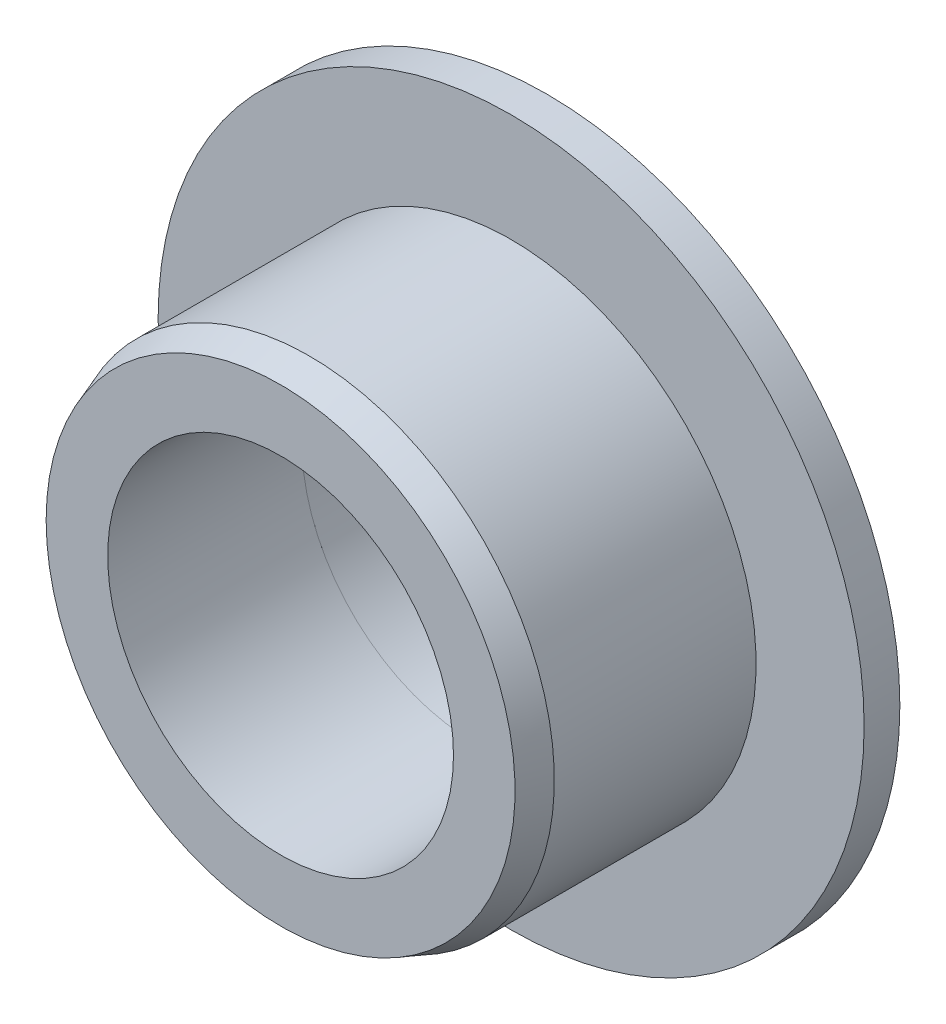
ISO-10303-21;
HEADER;
FILE_DESCRIPTION(('STEP AP214'),'2;1');
FILE_NAME('part.step','',(''),(''),'','','');
FILE_SCHEMA(('AUTOMOTIVE_DESIGN { 1 0 10303 214 1 1 1 1 }'));
ENDSEC;
DATA;
#1=APPLICATION_CONTEXT('core data for automotive mechanical design processes');
#2=APPLICATION_PROTOCOL_DEFINITION('international standard','automotive_design',2000,#1);
#3=PRODUCT_CONTEXT('',#1,'mechanical');
#4=PRODUCT('Part','Part','',(#3));
#5=PRODUCT_RELATED_PRODUCT_CATEGORY('part','',(#4));
#6=PRODUCT_DEFINITION_FORMATION('','',#4);
#7=PRODUCT_DEFINITION_CONTEXT('part definition',#1,'design');
#8=PRODUCT_DEFINITION('design','',#6,#7);
#9=PRODUCT_DEFINITION_SHAPE('','',#8);
#10=(LENGTH_UNIT() NAMED_UNIT(*) SI_UNIT(.MILLI.,.METRE.));
#11=(NAMED_UNIT(*) PLANE_ANGLE_UNIT() SI_UNIT($,.RADIAN.));
#12=(NAMED_UNIT(*) SI_UNIT($,.STERADIAN.) SOLID_ANGLE_UNIT());
#13=UNCERTAINTY_MEASURE_WITH_UNIT(LENGTH_MEASURE(1.E-05),#10,'distance_accuracy_value','');
#14=(GEOMETRIC_REPRESENTATION_CONTEXT(3) GLOBAL_UNCERTAINTY_ASSIGNED_CONTEXT((#13)) GLOBAL_UNIT_ASSIGNED_CONTEXT((#10,
#11,#12)) REPRESENTATION_CONTEXT('',''));
#15=CARTESIAN_POINT('',(0.,0.,0.));
#16=DIRECTION('',(0.,0.,1.));
#17=DIRECTION('',(1.,0.,0.));
#18=AXIS2_PLACEMENT_3D('',#15,#16,#17);
#19=CARTESIAN_POINT('',(-2.22044604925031E-13,6.66133814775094E-13,-2.22044604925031E-13));
#20=DIRECTION('',(0.,0.,1.));
#21=DIRECTION('',(1.,0.,0.));
#22=AXIS2_PLACEMENT_3D('',#19,#20,#21);
#23=CYLINDRICAL_SURFACE('',#22,12.);
#24=CARTESIAN_POINT('',(6.66133814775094E-13,-8.88178419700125E-13,18.4799999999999));
#25=DIRECTION('',(0.,0.,1.));
#26=DIRECTION('',(1.,0.,0.));
#27=AXIS2_PLACEMENT_3D('',#24,#25,#26);
#28=CIRCLE('',#27,12.);
#29=CARTESIAN_POINT('',(11.9999999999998,6.9150019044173E-13,18.4799999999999));
#30=VERTEX_POINT('',#29);
#31=EDGE_CURVE('E56',#30,#30,#28,.T.);
#32=CARTESIAN_POINT('',(2.22044604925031E-13,4.44089209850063E-13,5.));
#33=DIRECTION('',(0.,0.,-1.));
#34=DIRECTION('',(-1.,0.,0.));
#35=AXIS2_PLACEMENT_3D('',#32,#33,#34);
#36=CIRCLE('',#35,12.);
#37=CARTESIAN_POINT('',(11.9999999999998,6.90003609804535E-13,5.00000000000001));
#38=VERTEX_POINT('',#37);
#39=EDGE_CURVE('E38',#38,#38,#36,.F.);
#40=CARTESIAN_POINT('',(11.9999999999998,6.9150019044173E-13,18.4799999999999));
#41=CARTESIAN_POINT('',(11.9999999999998,6.91484601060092E-13,18.3395833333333));
#42=CARTESIAN_POINT('',(11.9999999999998,6.91469011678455E-13,18.1991666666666));
#43=CARTESIAN_POINT('',(11.9999999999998,6.9143783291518E-13,17.9183333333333));
#44=CARTESIAN_POINT('',(11.9999999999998,6.91422243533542E-13,17.7779166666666));
#45=CARTESIAN_POINT('',(11.9999999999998,6.91391064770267E-13,17.4970833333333));
#46=CARTESIAN_POINT('',(11.9999999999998,6.9137547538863E-13,17.3566666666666));
#47=CARTESIAN_POINT('',(11.9999999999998,6.91344296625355E-13,17.0758333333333));
#48=CARTESIAN_POINT('',(11.9999999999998,6.91328707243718E-13,16.9354166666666));
#49=CARTESIAN_POINT('',(11.9999999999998,6.91297528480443E-13,16.6545833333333));
#50=CARTESIAN_POINT('',(11.9999999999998,6.91281939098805E-13,16.5141666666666));
#51=CARTESIAN_POINT('',(11.9999999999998,6.9125076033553E-13,16.2333333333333));
#52=CARTESIAN_POINT('',(11.9999999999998,6.91235170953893E-13,16.0929166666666));
#53=CARTESIAN_POINT('',(11.9999999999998,6.91203992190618E-13,15.8120833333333));
#54=CARTESIAN_POINT('',(11.9999999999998,6.91188402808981E-13,15.6716666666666));
#55=CARTESIAN_POINT('',(11.9999999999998,6.91157224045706E-13,15.3908333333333));
#56=CARTESIAN_POINT('',(11.9999999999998,6.91141634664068E-13,15.2504166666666));
#57=CARTESIAN_POINT('',(11.9999999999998,6.91110455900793E-13,14.9695833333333));
#58=CARTESIAN_POINT('',(11.9999999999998,6.91094866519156E-13,14.8291666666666));
#59=CARTESIAN_POINT('',(11.9999999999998,6.91063687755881E-13,14.5483333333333));
#60=CARTESIAN_POINT('',(11.9999999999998,6.91048098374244E-13,14.4079166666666));
#61=CARTESIAN_POINT('',(11.9999999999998,6.91016919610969E-13,14.1270833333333));
#62=CARTESIAN_POINT('',(11.9999999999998,6.91001330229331E-13,13.9866666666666));
#63=CARTESIAN_POINT('',(11.9999999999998,6.90970151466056E-13,13.7058333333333));
#64=CARTESIAN_POINT('',(11.9999999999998,6.90954562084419E-13,13.5654166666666));
#65=CARTESIAN_POINT('',(11.9999999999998,6.90923383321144E-13,13.2845833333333));
#66=CARTESIAN_POINT('',(11.9999999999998,6.90907793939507E-13,13.1441666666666));
#67=CARTESIAN_POINT('',(11.9999999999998,6.90876615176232E-13,12.8633333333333));
#68=CARTESIAN_POINT('',(11.9999999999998,6.90861025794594E-13,12.7229166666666));
#69=CARTESIAN_POINT('',(11.9999999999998,6.90829847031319E-13,12.4420833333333));
#70=CARTESIAN_POINT('',(11.9999999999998,6.90814257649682E-13,12.3016666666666));
#71=CARTESIAN_POINT('',(11.9999999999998,6.90783078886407E-13,12.0208333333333));
#72=CARTESIAN_POINT('',(11.9999999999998,6.9076748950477E-13,11.8804166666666));
#73=CARTESIAN_POINT('',(11.9999999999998,6.90736310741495E-13,11.5995833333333));
#74=CARTESIAN_POINT('',(11.9999999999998,6.90720721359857E-13,11.4591666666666));
#75=CARTESIAN_POINT('',(11.9999999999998,6.90689542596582E-13,11.1783333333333));
#76=CARTESIAN_POINT('',(11.9999999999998,6.90673953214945E-13,11.0379166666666));
#77=CARTESIAN_POINT('',(11.9999999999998,6.9064277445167E-13,10.7570833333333));
#78=CARTESIAN_POINT('',(11.9999999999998,6.90627185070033E-13,10.6166666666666));
#79=CARTESIAN_POINT('',(11.9999999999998,6.90596006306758E-13,10.3358333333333));
#80=CARTESIAN_POINT('',(11.9999999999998,6.9058041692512E-13,10.1954166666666));
#81=CARTESIAN_POINT('',(11.9999999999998,6.90549238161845E-13,9.91458333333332));
#82=CARTESIAN_POINT('',(11.9999999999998,6.90533648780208E-13,9.77416666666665));
#83=CARTESIAN_POINT('',(11.9999999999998,6.90502470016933E-13,9.49333333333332));
#84=CARTESIAN_POINT('',(11.9999999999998,6.90486880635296E-13,9.35291666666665));
#85=CARTESIAN_POINT('',(11.9999999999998,6.90455701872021E-13,9.07208333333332));
#86=CARTESIAN_POINT('',(11.9999999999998,6.90440112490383E-13,8.93166666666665));
#87=CARTESIAN_POINT('',(11.9999999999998,6.90408933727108E-13,8.65083333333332));
#88=CARTESIAN_POINT('',(11.9999999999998,6.90393344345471E-13,8.51041666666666));
#89=CARTESIAN_POINT('',(11.9999999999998,6.90362165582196E-13,8.22958333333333));
#90=CARTESIAN_POINT('',(11.9999999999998,6.90346576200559E-13,8.08916666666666));
#91=CARTESIAN_POINT('',(11.9999999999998,6.90315397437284E-13,7.80833333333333));
#92=CARTESIAN_POINT('',(11.9999999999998,6.90299808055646E-13,7.66791666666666));
#93=CARTESIAN_POINT('',(11.9999999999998,6.90268629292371E-13,7.38708333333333));
#94=CARTESIAN_POINT('',(11.9999999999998,6.90253039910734E-13,7.24666666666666));
#95=CARTESIAN_POINT('',(11.9999999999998,6.90221861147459E-13,6.96583333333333));
#96=CARTESIAN_POINT('',(11.9999999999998,6.90206271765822E-13,6.82541666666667));
#97=CARTESIAN_POINT('',(11.9999999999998,6.90175093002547E-13,6.54458333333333));
#98=CARTESIAN_POINT('',(11.9999999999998,6.90159503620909E-13,6.40416666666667));
#99=CARTESIAN_POINT('',(11.9999999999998,6.90128324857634E-13,6.12333333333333));
#100=CARTESIAN_POINT('',(11.9999999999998,6.90112735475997E-13,5.98291666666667));
#101=CARTESIAN_POINT('',(11.9999999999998,6.90081556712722E-13,5.70208333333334));
#102=CARTESIAN_POINT('',(11.9999999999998,6.90065967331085E-13,5.56166666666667));
#103=CARTESIAN_POINT('',(11.9999999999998,6.9003478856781E-13,5.28083333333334));
#104=CARTESIAN_POINT('',(11.9999999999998,6.90019199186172E-13,5.14041666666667));
#105=CARTESIAN_POINT('',(11.9999999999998,6.90003609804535E-13,5.00000000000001));
#106=B_SPLINE_CURVE_WITH_KNOTS('',3,(#40,#41,#42,#43,#44,#45,#46,#47,#48,#49,#50,#51,#52,#53,
#54,#55,#56,#57,#58,#59,#60,#61,#62,#63,#64,#65,#66,#67,#68,#69,#70,#71,#72,#73,#74,#75,#76,#77,
#78,#79,#80,#81,#82,#83,#84,#85,#86,#87,#88,#89,#90,#91,#92,#93,#94,#95,#96,#97,#98,#99,#100,
#101,#102,#103,#104,#105),.UNSPECIFIED.,.F.,.F.,(4,2,2,2,2,2,2,2,2,2,2,2,2,2,2,2,2,2,2,2,2,2,2,
2,2,2,2,2,2,2,2,2,4),(0.,0.421249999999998,0.842499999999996,1.26374999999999,1.68499999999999,
2.10624999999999,2.52749999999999,2.94874999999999,3.36999999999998,3.79124999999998,
4.21249999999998,4.63374999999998,5.05499999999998,5.47624999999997,5.89749999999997,
6.31874999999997,6.73999999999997,7.16124999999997,7.58249999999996,8.00374999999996,
8.42499999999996,8.84624999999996,9.26749999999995,9.68874999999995,10.11,10.5312499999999,
10.9524999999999,11.3737499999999,11.7949999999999,12.2162499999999,12.6374999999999,
13.0587499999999,13.4799999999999),.UNSPECIFIED.);
#107=EDGE_CURVE('BSEAM34',#30,#38,#106,.T.);
#108=ORIENTED_EDGE('',*,*,#31,.T.);
#109=ORIENTED_EDGE('',*,*,#39,.F.);
#110=ORIENTED_EDGE('',*,*,#107,.T.);
#111=ORIENTED_EDGE('',*,*,#107,.F.);
#112=EDGE_LOOP('',(#108,#110,#109,#111));
#113=FACE_BOUND('',#112,.T.);
#114=ADVANCED_FACE('F34',(#113),#23,.F.);
#115=CARTESIAN_POINT('',(7.7715611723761E-13,6.66133814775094E-13,2.47999999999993));
#116=DIRECTION('',(0.,0.,1.));
#117=DIRECTION('',(1.,0.,0.));
#118=AXIS2_PLACEMENT_3D('',#115,#116,#117);
#119=PLANE('',#118);
#120=CARTESIAN_POINT('',(7.7715611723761E-13,6.66133814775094E-13,2.47999999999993));
#121=DIRECTION('',(0.,0.,1.));
#122=DIRECTION('',(1.,0.,0.));
#123=AXIS2_PLACEMENT_3D('',#120,#121,#122);
#124=CIRCLE('',#123,24.5);
#125=CARTESIAN_POINT('',(-24.4999999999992,6.1853300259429E-13,2.47999999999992));
#126=VERTEX_POINT('',#125);
#127=EDGE_CURVE('E70',#126,#126,#124,.T.);
#128=ORIENTED_EDGE('',*,*,#127,.T.);
#129=EDGE_LOOP('',(#128));
#130=FACE_BOUND('',#129,.T.);
#131=CARTESIAN_POINT('',(7.7715611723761E-13,6.66133814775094E-13,2.47999999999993));
#132=DIRECTION('',(0.,0.,1.));
#133=DIRECTION('',(1.,0.,0.));
#134=AXIS2_PLACEMENT_3D('',#131,#132,#133);
#135=CIRCLE('',#134,17.);
#136=CARTESIAN_POINT('',(-16.9999999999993,-9.22983911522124E-13,2.47999999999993));
#137=VERTEX_POINT('',#136);
#138=EDGE_CURVE('E64',#137,#137,#135,.T.);
#139=ORIENTED_EDGE('',*,*,#138,.F.);
#140=EDGE_LOOP('',(#139));
#141=FACE_BOUND('',#140,.T.);
#142=ADVANCED_FACE('F95',(#130,#141),#119,.T.);
#143=CARTESIAN_POINT('',(7.7715611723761E-13,6.66133814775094E-13,2.47999999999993));
#144=DIRECTION('',(0.,0.,-1.));
#145=DIRECTION('',(-1.,0.,0.));
#146=AXIS2_PLACEMENT_3D('',#143,#144,#145);
#147=CYLINDRICAL_SURFACE('',#146,24.5);
#148=CARTESIAN_POINT('',(-2.22044604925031E-13,6.66133814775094E-13,-2.22044604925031E-13));
#149=DIRECTION('',(0.,0.,1.));
#150=DIRECTION('',(1.,0.,0.));
#151=AXIS2_PLACEMENT_3D('',#148,#149,#150);
#152=CIRCLE('',#151,24.5);
#153=CARTESIAN_POINT('',(-24.4999999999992,6.18257667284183E-13,-2.26381413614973E-13));
#154=VERTEX_POINT('',#153);
#155=EDGE_CURVE('E67',#154,#154,#152,.T.);
#156=CARTESIAN_POINT('',(-24.4999999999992,6.1853300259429E-13,2.47999999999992));
#157=CARTESIAN_POINT('',(-24.4999999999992,6.18530134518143E-13,2.45416666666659));
#158=CARTESIAN_POINT('',(-24.4999999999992,6.18527266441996E-13,2.42833333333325));
#159=CARTESIAN_POINT('',(-24.4999999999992,6.18521530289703E-13,2.37666666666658));
#160=CARTESIAN_POINT('',(-24.4999999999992,6.18518662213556E-13,2.35083333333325));
#161=CARTESIAN_POINT('',(-24.4999999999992,6.18512926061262E-13,2.29916666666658));
#162=CARTESIAN_POINT('',(-24.4999999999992,6.18510057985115E-13,2.27333333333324));
#163=CARTESIAN_POINT('',(-24.4999999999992,6.18504321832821E-13,2.22166666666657));
#164=CARTESIAN_POINT('',(-24.4999999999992,6.18501453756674E-13,2.19583333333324));
#165=CARTESIAN_POINT('',(-24.4999999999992,6.1849571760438E-13,2.14416666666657));
#166=CARTESIAN_POINT('',(-24.4999999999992,6.18492849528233E-13,2.11833333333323));
#167=CARTESIAN_POINT('',(-24.4999999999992,6.18487113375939E-13,2.06666666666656));
#168=CARTESIAN_POINT('',(-24.4999999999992,6.18484245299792E-13,2.04083333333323));
#169=CARTESIAN_POINT('',(-24.4999999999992,6.18478509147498E-13,1.98916666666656));
#170=CARTESIAN_POINT('',(-24.4999999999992,6.18475641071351E-13,1.96333333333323));
#171=CARTESIAN_POINT('',(-24.4999999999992,6.18469904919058E-13,1.91166666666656));
#172=CARTESIAN_POINT('',(-24.4999999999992,6.18467036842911E-13,1.88583333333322));
#173=CARTESIAN_POINT('',(-24.4999999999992,6.18461300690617E-13,1.83416666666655));
#174=CARTESIAN_POINT('',(-24.4999999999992,6.1845843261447E-13,1.80833333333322));
#175=CARTESIAN_POINT('',(-24.4999999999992,6.18452696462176E-13,1.75666666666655));
#176=CARTESIAN_POINT('',(-24.4999999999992,6.18449828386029E-13,1.73083333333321));
#177=CARTESIAN_POINT('',(-24.4999999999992,6.18444092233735E-13,1.67916666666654));
#178=CARTESIAN_POINT('',(-24.4999999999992,6.18441224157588E-13,1.65333333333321));
#179=CARTESIAN_POINT('',(-24.4999999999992,6.18435488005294E-13,1.60166666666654));
#180=CARTESIAN_POINT('',(-24.4999999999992,6.18432619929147E-13,1.5758333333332));
#181=CARTESIAN_POINT('',(-24.4999999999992,6.18426883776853E-13,1.52416666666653));
#182=CARTESIAN_POINT('',(-24.4999999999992,6.18424015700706E-13,1.4983333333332));
#183=CARTESIAN_POINT('',(-24.4999999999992,6.18418279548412E-13,1.44666666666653));
#184=CARTESIAN_POINT('',(-24.4999999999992,6.18415411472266E-13,1.42083333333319));
#185=CARTESIAN_POINT('',(-24.4999999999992,6.18409675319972E-13,1.36916666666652));
#186=CARTESIAN_POINT('',(-24.4999999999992,6.18406807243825E-13,1.34333333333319));
#187=CARTESIAN_POINT('',(-24.4999999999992,6.18401071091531E-13,1.29166666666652));
#188=CARTESIAN_POINT('',(-24.4999999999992,6.18398203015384E-13,1.26583333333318));
#189=CARTESIAN_POINT('',(-24.4999999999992,6.1839246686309E-13,1.21416666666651));
#190=CARTESIAN_POINT('',(-24.4999999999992,6.18389598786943E-13,1.18833333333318));
#191=CARTESIAN_POINT('',(-24.4999999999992,6.18383862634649E-13,1.13666666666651));
#192=CARTESIAN_POINT('',(-24.4999999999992,6.18380994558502E-13,1.11083333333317));
#193=CARTESIAN_POINT('',(-24.4999999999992,6.18375258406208E-13,1.0591666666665));
#194=CARTESIAN_POINT('',(-24.4999999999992,6.18372390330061E-13,1.03333333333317));
#195=CARTESIAN_POINT('',(-24.4999999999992,6.18366654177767E-13,0.981666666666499));
#196=CARTESIAN_POINT('',(-24.4999999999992,6.1836378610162E-13,0.955833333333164));
#197=CARTESIAN_POINT('',(-24.4999999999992,6.18358049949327E-13,0.904166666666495));
#198=CARTESIAN_POINT('',(-24.4999999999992,6.1835518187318E-13,0.87833333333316));
#199=CARTESIAN_POINT('',(-24.4999999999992,6.18349445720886E-13,0.82666666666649));
#200=CARTESIAN_POINT('',(-24.4999999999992,6.18346577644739E-13,0.800833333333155));
#201=CARTESIAN_POINT('',(-24.4999999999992,6.18340841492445E-13,0.749166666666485));
#202=CARTESIAN_POINT('',(-24.4999999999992,6.18337973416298E-13,0.723333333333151));
#203=CARTESIAN_POINT('',(-24.4999999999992,6.18332237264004E-13,0.671666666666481));
#204=CARTESIAN_POINT('',(-24.4999999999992,6.18329369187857E-13,0.645833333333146));
#205=CARTESIAN_POINT('',(-24.4999999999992,6.18323633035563E-13,0.594166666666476));
#206=CARTESIAN_POINT('',(-24.4999999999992,6.18320764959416E-13,0.568333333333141));
#207=CARTESIAN_POINT('',(-24.4999999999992,6.18315028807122E-13,0.516666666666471));
#208=CARTESIAN_POINT('',(-24.4999999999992,6.18312160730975E-13,0.490833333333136));
#209=CARTESIAN_POINT('',(-24.4999999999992,6.18306424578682E-13,0.439166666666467));
#210=CARTESIAN_POINT('',(-24.4999999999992,6.18303556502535E-13,0.413333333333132));
#211=CARTESIAN_POINT('',(-24.4999999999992,6.18297820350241E-13,0.361666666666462));
#212=CARTESIAN_POINT('',(-24.4999999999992,6.18294952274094E-13,0.335833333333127));
#213=CARTESIAN_POINT('',(-24.4999999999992,6.182892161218E-13,0.284166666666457));
#214=CARTESIAN_POINT('',(-24.4999999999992,6.18286348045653E-13,0.258333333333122));
#215=CARTESIAN_POINT('',(-24.4999999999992,6.18280611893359E-13,0.206666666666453));
#216=CARTESIAN_POINT('',(-24.4999999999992,6.18277743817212E-13,0.180833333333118));
#217=CARTESIAN_POINT('',(-24.4999999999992,6.18272007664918E-13,0.129166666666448));
#218=CARTESIAN_POINT('',(-24.4999999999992,6.18269139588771E-13,0.103333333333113));
#219=CARTESIAN_POINT('',(-24.4999999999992,6.18263403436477E-13,0.0516666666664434));
#220=CARTESIAN_POINT('',(-24.4999999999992,6.1826053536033E-13,0.0258333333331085));
#221=CARTESIAN_POINT('',(-24.4999999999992,6.18257667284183E-13,-2.26381413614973E-13));
#222=B_SPLINE_CURVE_WITH_KNOTS('',3,(#156,#157,#158,#159,#160,#161,#162,#163,#164,#165,#166,
#167,#168,#169,#170,#171,#172,#173,#174,#175,#176,#177,#178,#179,#180,#181,#182,#183,#184,#185,
#186,#187,#188,#189,#190,#191,#192,#193,#194,#195,#196,#197,#198,#199,#200,#201,#202,#203,#204,
#205,#206,#207,#208,#209,#210,#211,#212,#213,#214,#215,#216,#217,#218,#219,#220,#221),
.UNSPECIFIED.,.F.,.F.,(4,2,2,2,2,2,2,2,2,2,2,2,2,2,2,2,2,2,2,2,2,2,2,2,2,2,2,2,2,2,2,2,4),(0.,
0.0775000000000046,0.155000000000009,0.232500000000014,0.310000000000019,0.387500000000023,
0.465000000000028,0.542500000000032,0.620000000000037,0.697500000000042,0.775000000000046,
0.852500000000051,0.930000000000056,1.00750000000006,1.08500000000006,1.16250000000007,
1.24000000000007,1.31750000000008,1.39500000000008,1.47250000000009,1.55000000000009,
1.6275000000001,1.7050000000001,1.78250000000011,1.86000000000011,1.93750000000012,
2.01500000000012,2.09250000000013,2.17000000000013,2.24750000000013,2.32500000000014,
2.40250000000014,2.48000000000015),.UNSPECIFIED.);
#223=EDGE_CURVE('BSEAM36',#126,#154,#222,.T.);
#224=ORIENTED_EDGE('',*,*,#127,.F.);
#225=ORIENTED_EDGE('',*,*,#155,.T.);
#226=ORIENTED_EDGE('',*,*,#223,.T.);
#227=ORIENTED_EDGE('',*,*,#223,.F.);
#228=EDGE_LOOP('',(#224,#226,#225,#227));
#229=FACE_BOUND('',#228,.T.);
#230=ADVANCED_FACE('F36',(#229),#147,.T.);
#231=CARTESIAN_POINT('',(-2.22044604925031E-13,6.66133814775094E-13,-2.22044604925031E-13));
#232=DIRECTION('',(0.,0.,1.));
#233=DIRECTION('',(1.,0.,0.));
#234=AXIS2_PLACEMENT_3D('',#231,#232,#233);
#235=PLANE('',#234);
#236=CARTESIAN_POINT('',(-2.22044604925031E-13,6.66133814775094E-13,-2.22044604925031E-13));
#237=DIRECTION('',(0.,0.,1.));
#238=DIRECTION('',(1.,0.,0.));
#239=AXIS2_PLACEMENT_3D('',#236,#237,#238);
#240=CIRCLE('',#239,12.5);
#241=CARTESIAN_POINT('',(-12.5000000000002,6.41847686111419E-13,-2.24126273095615E-13));
#242=VERTEX_POINT('',#241);
#243=EDGE_CURVE('E10',#242,#242,#240,.T.);
#244=ORIENTED_EDGE('',*,*,#243,.T.);
#245=EDGE_LOOP('',(#244));
#246=FACE_BOUND('',#245,.T.);
#247=ORIENTED_EDGE('',*,*,#155,.F.);
#248=EDGE_LOOP('',(#247));
#249=FACE_BOUND('',#248,.T.);
#250=ADVANCED_FACE('F133',(#246,#249),#235,.F.);
#251=CARTESIAN_POINT('',(6.66133814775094E-13,-8.88178419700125E-13,18.4799999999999));
#252=DIRECTION('',(0.,0.,-1.));
#253=DIRECTION('',(-1.,0.,0.));
#254=AXIS2_PLACEMENT_3D('',#251,#252,#253);
#255=CYLINDRICAL_SURFACE('',#254,17.);
#256=CARTESIAN_POINT('',(1.11022302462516E-13,4.44089209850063E-13,16.4799999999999));
#257=DIRECTION('',(0.,0.,1.));
#258=DIRECTION('',(1.,0.,0.));
#259=AXIS2_PLACEMENT_3D('',#256,#257,#258);
#260=CIRCLE('',#259,17.);
#261=CARTESIAN_POINT('',(-16.9999999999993,-9.21429599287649E-13,16.4799999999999));
#262=VERTEX_POINT('',#261);
#263=EDGE_CURVE('E42',#262,#262,#260,.F.);
#264=CARTESIAN_POINT('',(-16.9999999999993,-9.21429599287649E-13,16.4799999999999));
#265=CARTESIAN_POINT('',(-16.9999999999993,-9.21445790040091E-13,16.3341666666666));
#266=CARTESIAN_POINT('',(-16.9999999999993,-9.21461980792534E-13,16.1883333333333));
#267=CARTESIAN_POINT('',(-16.9999999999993,-9.21494362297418E-13,15.8966666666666));
#268=CARTESIAN_POINT('',(-16.9999999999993,-9.21510553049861E-13,15.7508333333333));
#269=CARTESIAN_POINT('',(-16.9999999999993,-9.21542934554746E-13,15.4591666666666));
#270=CARTESIAN_POINT('',(-16.9999999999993,-9.21559125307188E-13,15.3133333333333));
#271=CARTESIAN_POINT('',(-16.9999999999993,-9.21591506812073E-13,15.0216666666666));
#272=CARTESIAN_POINT('',(-16.9999999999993,-9.21607697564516E-13,14.8758333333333));
#273=CARTESIAN_POINT('',(-16.9999999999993,-9.216400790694E-13,14.5841666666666));
#274=CARTESIAN_POINT('',(-16.9999999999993,-9.21656269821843E-13,14.4383333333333));
#275=CARTESIAN_POINT('',(-16.9999999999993,-9.21688651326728E-13,14.1466666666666));
#276=CARTESIAN_POINT('',(-16.9999999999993,-9.2170484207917E-13,14.0008333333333));
#277=CARTESIAN_POINT('',(-16.9999999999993,-9.21737223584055E-13,13.7091666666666));
#278=CARTESIAN_POINT('',(-16.9999999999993,-9.21753414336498E-13,13.5633333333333));
#279=CARTESIAN_POINT('',(-16.9999999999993,-9.21785795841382E-13,13.2716666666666));
#280=CARTESIAN_POINT('',(-16.9999999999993,-9.21801986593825E-13,13.1258333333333));
#281=CARTESIAN_POINT('',(-16.9999999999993,-9.2183436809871E-13,12.8341666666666));
#282=CARTESIAN_POINT('',(-16.9999999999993,-9.21850558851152E-13,12.6883333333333));
#283=CARTESIAN_POINT('',(-16.9999999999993,-9.21882940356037E-13,12.3966666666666));
#284=CARTESIAN_POINT('',(-16.9999999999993,-9.2189913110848E-13,12.2508333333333));
#285=CARTESIAN_POINT('',(-16.9999999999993,-9.21931512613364E-13,11.9591666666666));
#286=CARTESIAN_POINT('',(-16.9999999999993,-9.21947703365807E-13,11.8133333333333));
#287=CARTESIAN_POINT('',(-16.9999999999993,-9.21980084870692E-13,11.5216666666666));
#288=CARTESIAN_POINT('',(-16.9999999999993,-9.21996275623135E-13,11.3758333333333));
#289=CARTESIAN_POINT('',(-16.9999999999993,-9.22028657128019E-13,11.0841666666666));
#290=CARTESIAN_POINT('',(-16.9999999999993,-9.22044847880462E-13,10.9383333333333));
#291=CARTESIAN_POINT('',(-16.9999999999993,-9.22077229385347E-13,10.6466666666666));
#292=CARTESIAN_POINT('',(-16.9999999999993,-9.22093420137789E-13,10.5008333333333));
#293=CARTESIAN_POINT('',(-16.9999999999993,-9.22125801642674E-13,10.2091666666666));
#294=CARTESIAN_POINT('',(-16.9999999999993,-9.22141992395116E-13,10.0633333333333));
#295=CARTESIAN_POINT('',(-16.9999999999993,-9.22174373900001E-13,9.7716666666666));
#296=CARTESIAN_POINT('',(-16.9999999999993,-9.22190564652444E-13,9.62583333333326));
#297=CARTESIAN_POINT('',(-16.9999999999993,-9.22222946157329E-13,9.3341666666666));
#298=CARTESIAN_POINT('',(-16.9999999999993,-9.22239136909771E-13,9.18833333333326));
#299=CARTESIAN_POINT('',(-16.9999999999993,-9.22271518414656E-13,8.8966666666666));
#300=CARTESIAN_POINT('',(-16.9999999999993,-9.22287709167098E-13,8.75083333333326));
#301=CARTESIAN_POINT('',(-16.9999999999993,-9.22320090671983E-13,8.4591666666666));
#302=CARTESIAN_POINT('',(-16.9999999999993,-9.22336281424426E-13,8.31333333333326));
#303=CARTESIAN_POINT('',(-16.9999999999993,-9.22368662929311E-13,8.0216666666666));
#304=CARTESIAN_POINT('',(-16.9999999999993,-9.22384853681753E-13,7.87583333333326));
#305=CARTESIAN_POINT('',(-16.9999999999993,-9.22417235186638E-13,7.5841666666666));
#306=CARTESIAN_POINT('',(-16.9999999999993,-9.22433425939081E-13,7.43833333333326));
#307=CARTESIAN_POINT('',(-16.9999999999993,-9.22465807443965E-13,7.1466666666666));
#308=CARTESIAN_POINT('',(-16.9999999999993,-9.22481998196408E-13,7.00083333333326));
#309=CARTESIAN_POINT('',(-16.9999999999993,-9.22514379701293E-13,6.7091666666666));
#310=CARTESIAN_POINT('',(-16.9999999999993,-9.22530570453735E-13,6.56333333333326));
#311=CARTESIAN_POINT('',(-16.9999999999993,-9.2256295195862E-13,6.27166666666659));
#312=CARTESIAN_POINT('',(-16.9999999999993,-9.22579142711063E-13,6.12583333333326));
#313=CARTESIAN_POINT('',(-16.9999999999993,-9.22611524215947E-13,5.83416666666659));
#314=CARTESIAN_POINT('',(-16.9999999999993,-9.2262771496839E-13,5.68833333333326));
#315=CARTESIAN_POINT('',(-16.9999999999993,-9.22660096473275E-13,5.39666666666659));
#316=CARTESIAN_POINT('',(-16.9999999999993,-9.22676287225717E-13,5.25083333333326));
#317=CARTESIAN_POINT('',(-16.9999999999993,-9.22708668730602E-13,4.95916666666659));
#318=CARTESIAN_POINT('',(-16.9999999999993,-9.22724859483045E-13,4.81333333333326));
#319=CARTESIAN_POINT('',(-16.9999999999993,-9.22757240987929E-13,4.52166666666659));
#320=CARTESIAN_POINT('',(-16.9999999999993,-9.22773431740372E-13,4.37583333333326));
#321=CARTESIAN_POINT('',(-16.9999999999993,-9.22805813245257E-13,4.08416666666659));
#322=CARTESIAN_POINT('',(-16.9999999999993,-9.228220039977E-13,3.93833333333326));
#323=CARTESIAN_POINT('',(-16.9999999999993,-9.22854385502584E-13,3.64666666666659));
#324=CARTESIAN_POINT('',(-16.9999999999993,-9.22870576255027E-13,3.50083333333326));
#325=CARTESIAN_POINT('',(-16.9999999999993,-9.22902957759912E-13,3.20916666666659));
#326=CARTESIAN_POINT('',(-16.9999999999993,-9.22919148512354E-13,3.06333333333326));
#327=CARTESIAN_POINT('',(-16.9999999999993,-9.22951530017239E-13,2.77166666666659));
#328=CARTESIAN_POINT('',(-16.9999999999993,-9.22967720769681E-13,2.62583333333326));
#329=CARTESIAN_POINT('',(-16.9999999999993,-9.22983911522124E-13,2.47999999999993));
#330=B_SPLINE_CURVE_WITH_KNOTS('',3,(#264,#265,#266,#267,#268,#269,#270,#271,#272,#273,#274,
#275,#276,#277,#278,#279,#280,#281,#282,#283,#284,#285,#286,#287,#288,#289,#290,#291,#292,#293,
#294,#295,#296,#297,#298,#299,#300,#301,#302,#303,#304,#305,#306,#307,#308,#309,#310,#311,#312,
#313,#314,#315,#316,#317,#318,#319,#320,#321,#322,#323,#324,#325,#326,#327,#328,#329),
.UNSPECIFIED.,.F.,.F.,(4,2,2,2,2,2,2,2,2,2,2,2,2,2,2,2,2,2,2,2,2,2,2,2,2,2,2,2,2,2,2,2,4),(0.,
0.4375,0.874999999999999,1.3125,1.75,2.1875,2.625,3.0625,3.5,3.9375,4.375,4.8125,5.25,5.6875,
6.125,6.5625,7.,7.4375,7.87500000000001,8.31250000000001,8.75000000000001,9.18750000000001,
9.62500000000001,10.0625,10.5,10.9375,11.375,11.8125,12.25,12.6875,13.125,13.5625,14.),.UNSPECIFIED.);
#331=EDGE_CURVE('BSEAM89',#262,#137,#330,.T.);
#332=ORIENTED_EDGE('',*,*,#263,.T.);
#333=ORIENTED_EDGE('',*,*,#138,.T.);
#334=ORIENTED_EDGE('',*,*,#331,.T.);
#335=ORIENTED_EDGE('',*,*,#331,.F.);
#336=EDGE_LOOP('',(#332,#334,#333,#335));
#337=FACE_BOUND('',#336,.T.);
#338=ADVANCED_FACE('F89',(#337),#255,.T.);
#339=CARTESIAN_POINT('',(6.66133814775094E-13,-8.88178419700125E-13,18.4799999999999));
#340=DIRECTION('',(0.,0.,1.));
#341=DIRECTION('',(1.,0.,0.));
#342=AXIS2_PLACEMENT_3D('',#339,#340,#341);
#343=PLANE('',#342);
#344=ORIENTED_EDGE('',*,*,#31,.F.);
#345=EDGE_LOOP('',(#344));
#346=FACE_BOUND('',#345,.T.);
#347=CARTESIAN_POINT('',(6.66133814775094E-13,-8.88178419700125E-13,18.4799999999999));
#348=DIRECTION('',(0.,0.,1.));
#349=DIRECTION('',(1.,0.,0.));
#350=AXIS2_PLACEMENT_3D('',#347,#348,#349);
#351=CIRCLE('',#350,16.2720595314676);
#352=CARTESIAN_POINT('',(-16.2720595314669,-9.19793246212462E-13,18.4799999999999));
#353=VERTEX_POINT('',#352);
#354=EDGE_CURVE('E47',#353,#353,#351,.T.);
#355=ORIENTED_EDGE('',*,*,#354,.T.);
#356=EDGE_LOOP('',(#355));
#357=FACE_BOUND('',#356,.T.);
#358=ADVANCED_FACE('F75',(#346,#357),#343,.T.);
#359=CARTESIAN_POINT('',(6.66133814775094E-13,-8.88178419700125E-13,18.4799999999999));
#360=DIRECTION('',(0.,0.,-1.));
#361=DIRECTION('',(-1.,0.,0.));
#362=AXIS2_PLACEMENT_3D('',#359,#360,#361);
#363=CONICAL_SURFACE('',#362,16.2720595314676,0.349065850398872);
#364=CARTESIAN_POINT('',(-16.9999999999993,-9.21429599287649E-13,16.4799999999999));
#365=CARTESIAN_POINT('',(-16.9924172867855,-9.21412553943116E-13,16.5008333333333));
#366=CARTESIAN_POINT('',(-16.9848345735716,-9.21395508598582E-13,16.5216666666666));
#367=CARTESIAN_POINT('',(-16.9696691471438,-9.21361417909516E-13,16.5633333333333));
#368=CARTESIAN_POINT('',(-16.9620864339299,-9.21344372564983E-13,16.5841666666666));
#369=CARTESIAN_POINT('',(-16.9469210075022,-9.21310281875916E-13,16.6258333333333));
#370=CARTESIAN_POINT('',(-16.9393382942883,-9.21293236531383E-13,16.6466666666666));
#371=CARTESIAN_POINT('',(-16.9241728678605,-9.21259145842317E-13,16.6883333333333));
#372=CARTESIAN_POINT('',(-16.9165901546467,-9.21242100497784E-13,16.7091666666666));
#373=CARTESIAN_POINT('',(-16.9014247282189,-9.21208009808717E-13,16.7508333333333));
#374=CARTESIAN_POINT('',(-16.893842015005,-9.21190964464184E-13,16.7716666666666));
#375=CARTESIAN_POINT('',(-16.8786765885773,-9.21156873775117E-13,16.8133333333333));
#376=CARTESIAN_POINT('',(-16.8710938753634,-9.21139828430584E-13,16.8341666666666));
#377=CARTESIAN_POINT('',(-16.8559284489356,-9.21105737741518E-13,16.8758333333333));
#378=CARTESIAN_POINT('',(-16.8483457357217,-9.21088692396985E-13,16.8966666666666));
#379=CARTESIAN_POINT('',(-16.833180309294,-9.21054601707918E-13,16.9383333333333));
#380=CARTESIAN_POINT('',(-16.8255975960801,-9.21037556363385E-13,16.9591666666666));
#381=CARTESIAN_POINT('',(-16.8104321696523,-9.21003465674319E-13,17.0008333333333));
#382=CARTESIAN_POINT('',(-16.8028494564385,-9.20986420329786E-13,17.0216666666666));
#383=CARTESIAN_POINT('',(-16.7876840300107,-9.20952329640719E-13,17.0633333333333));
#384=CARTESIAN_POINT('',(-16.7801013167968,-9.20935284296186E-13,17.0841666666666));
#385=CARTESIAN_POINT('',(-16.7649358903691,-9.2090119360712E-13,17.1258333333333));
#386=CARTESIAN_POINT('',(-16.7573531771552,-9.20884148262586E-13,17.1466666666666));
#387=CARTESIAN_POINT('',(-16.7421877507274,-9.2085005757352E-13,17.1883333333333));
#388=CARTESIAN_POINT('',(-16.7346050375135,-9.20833012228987E-13,17.2091666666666));
#389=CARTESIAN_POINT('',(-16.7194396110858,-9.20798921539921E-13,17.2508333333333));
#390=CARTESIAN_POINT('',(-16.7118568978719,-9.20781876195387E-13,17.2716666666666));
#391=CARTESIAN_POINT('',(-16.6966914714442,-9.20747785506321E-13,17.3133333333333));
#392=CARTESIAN_POINT('',(-16.6891087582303,-9.20730740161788E-13,17.3341666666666));
#393=CARTESIAN_POINT('',(-16.6739433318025,-9.20696649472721E-13,17.3758333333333));
#394=CARTESIAN_POINT('',(-16.6663606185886,-9.20679604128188E-13,17.3966666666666));
#395=CARTESIAN_POINT('',(-16.6511951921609,-9.20645513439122E-13,17.4383333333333));
#396=CARTESIAN_POINT('',(-16.643612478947,-9.20628468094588E-13,17.4591666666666));
#397=CARTESIAN_POINT('',(-16.6284470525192,-9.20594377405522E-13,17.5008333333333));
#398=CARTESIAN_POINT('',(-16.6208643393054,-9.20577332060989E-13,17.5216666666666));
#399=CARTESIAN_POINT('',(-16.6056989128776,-9.20543241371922E-13,17.5633333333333));
#400=CARTESIAN_POINT('',(-16.5981161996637,-9.20526196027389E-13,17.5841666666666));
#401=CARTESIAN_POINT('',(-16.582950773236,-9.20492105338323E-13,17.6258333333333));
#402=CARTESIAN_POINT('',(-16.5753680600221,-9.2047505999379E-13,17.6466666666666));
#403=CARTESIAN_POINT('',(-16.5602026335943,-9.20440969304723E-13,17.6883333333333));
#404=CARTESIAN_POINT('',(-16.5526199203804,-9.2042392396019E-13,17.7091666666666));
#405=CARTESIAN_POINT('',(-16.5374544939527,-9.20389833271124E-13,17.7508333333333));
#406=CARTESIAN_POINT('',(-16.5298717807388,-9.2037278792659E-13,17.7716666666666));
#407=CARTESIAN_POINT('',(-16.514706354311,-9.20338697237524E-13,17.8133333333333));
#408=CARTESIAN_POINT('',(-16.5071236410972,-9.20321651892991E-13,17.8341666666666));
#409=CARTESIAN_POINT('',(-16.4919582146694,-9.20287561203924E-13,17.8758333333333));
#410=CARTESIAN_POINT('',(-16.4843755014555,-9.20270515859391E-13,17.8966666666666));
#411=CARTESIAN_POINT('',(-16.4692100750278,-9.20236425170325E-13,17.9383333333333));
#412=CARTESIAN_POINT('',(-16.4616273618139,-9.20219379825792E-13,17.9591666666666));
#413=CARTESIAN_POINT('',(-16.4464619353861,-9.20185289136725E-13,18.0008333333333));
#414=CARTESIAN_POINT('',(-16.4388792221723,-9.20168243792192E-13,18.0216666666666));
#415=CARTESIAN_POINT('',(-16.4237137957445,-9.20134153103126E-13,18.0633333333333));
#416=CARTESIAN_POINT('',(-16.4161310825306,-9.20117107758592E-13,18.0841666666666));
#417=CARTESIAN_POINT('',(-16.4009656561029,-9.20083017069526E-13,18.1258333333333));
#418=CARTESIAN_POINT('',(-16.393382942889,-9.20065971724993E-13,18.1466666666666));
#419=CARTESIAN_POINT('',(-16.3782175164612,-9.20031881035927E-13,18.1883333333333));
#420=CARTESIAN_POINT('',(-16.3706348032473,-9.20014835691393E-13,18.2091666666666));
#421=CARTESIAN_POINT('',(-16.3554693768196,-9.19980745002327E-13,18.2508333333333));
#422=CARTESIAN_POINT('',(-16.3478866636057,-9.19963699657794E-13,18.2716666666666));
#423=CARTESIAN_POINT('',(-16.3327212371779,-9.19929608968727E-13,18.3133333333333));
#424=CARTESIAN_POINT('',(-16.3251385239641,-9.19912563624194E-13,18.3341666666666));
#425=CARTESIAN_POINT('',(-16.3099730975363,-9.19878472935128E-13,18.3758333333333));
#426=CARTESIAN_POINT('',(-16.3023903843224,-9.19861427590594E-13,18.3966666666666));
#427=CARTESIAN_POINT('',(-16.2872249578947,-9.19827336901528E-13,18.4383333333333));
#428=CARTESIAN_POINT('',(-16.2796422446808,-9.19810291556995E-13,18.4591666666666));
#429=CARTESIAN_POINT('',(-16.2720595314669,-9.19793246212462E-13,18.4799999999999));
#430=B_SPLINE_CURVE_WITH_KNOTS('',3,(#364,#365,#366,#367,#368,#369,#370,#371,#372,#373,#374,
#375,#376,#377,#378,#379,#380,#381,#382,#383,#384,#385,#386,#387,#388,#389,#390,#391,#392,#393,
#394,#395,#396,#397,#398,#399,#400,#401,#402,#403,#404,#405,#406,#407,#408,#409,#410,#411,#412,
#413,#414,#415,#416,#417,#418,#419,#420,#421,#422,#423,#424,#425,#426,#427,#428,#429),
.UNSPECIFIED.,.F.,.F.,(4,2,2,2,2,2,2,2,2,2,2,2,2,2,2,2,2,2,2,2,2,2,2,2,2,2,2,2,2,2,2,2,4),(0.,
0.0665111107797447,0.133022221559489,0.199533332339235,0.26604444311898,0.332555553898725,
0.399066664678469,0.465577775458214,0.532088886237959,0.598599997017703,0.665111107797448,
0.731622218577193,0.798133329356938,0.864644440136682,0.931155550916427,0.997666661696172,
1.06417777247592,1.13068888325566,1.19719999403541,1.26371110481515,1.3302222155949,
1.39673332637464,1.46324443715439,1.52975554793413,1.59626665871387,1.66277776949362,
1.72928888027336,1.79579999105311,1.86231110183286,1.9288222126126,1.99533332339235,
2.06184443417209,2.12835554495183),.UNSPECIFIED.);
#431=EDGE_CURVE('BSEAM77',#262,#353,#430,.T.);
#432=ORIENTED_EDGE('',*,*,#263,.F.);
#433=ORIENTED_EDGE('',*,*,#354,.F.);
#434=ORIENTED_EDGE('',*,*,#431,.T.);
#435=ORIENTED_EDGE('',*,*,#431,.F.);
#436=EDGE_LOOP('',(#432,#434,#433,#435));
#437=FACE_BOUND('',#436,.T.);
#438=ADVANCED_FACE('F77',(#437),#363,.T.);
#439=CARTESIAN_POINT('',(-2.22044604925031E-13,6.66133814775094E-13,-2.22044604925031E-13));
#440=DIRECTION('',(0.,0.,-1.));
#441=DIRECTION('',(-1.,0.,0.));
#442=AXIS2_PLACEMENT_3D('',#439,#440,#441);
#443=CONICAL_SURFACE('',#442,12.5,0.785398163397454);
#444=CARTESIAN_POINT('',(7.7715611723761E-13,2.22044604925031E-13,0.449999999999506));
#445=DIRECTION('',(0.,0.,-1.));
#446=DIRECTION('',(-1.,0.,0.));
#447=AXIS2_PLACEMENT_3D('',#444,#445,#446);
#448=CIRCLE('',#447,12.05);
#449=CARTESIAN_POINT('',(-12.0500000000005,6.42771946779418E-13,0.449999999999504));
#450=VERTEX_POINT('',#449);
#451=EDGE_CURVE('E50',#450,#450,#448,.T.);
#452=CARTESIAN_POINT('',(-12.0500000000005,6.42771946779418E-13,0.449999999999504));
#453=CARTESIAN_POINT('',(-12.0546875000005,6.42762319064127E-13,0.445312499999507));
#454=CARTESIAN_POINT('',(-12.0593750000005,6.42752691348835E-13,0.44062499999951));
#455=CARTESIAN_POINT('',(-12.0687500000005,6.42733435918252E-13,0.431249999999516));
#456=CARTESIAN_POINT('',(-12.0734375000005,6.4272380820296E-13,0.426562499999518));
#457=CARTESIAN_POINT('',(-12.0828125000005,6.42704552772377E-13,0.417187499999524));
#458=CARTESIAN_POINT('',(-12.0875000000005,6.42694925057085E-13,0.412499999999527));
#459=CARTESIAN_POINT('',(-12.0968750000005,6.42675669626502E-13,0.403124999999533));
#460=CARTESIAN_POINT('',(-12.1015625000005,6.4266604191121E-13,0.398437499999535));
#461=CARTESIAN_POINT('',(-12.1109375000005,6.42646786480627E-13,0.389062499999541));
#462=CARTESIAN_POINT('',(-12.1156250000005,6.42637158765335E-13,0.384374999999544));
#463=CARTESIAN_POINT('',(-12.1250000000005,6.42617903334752E-13,0.37499999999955));
#464=CARTESIAN_POINT('',(-12.1296875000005,6.4260827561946E-13,0.370312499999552));
#465=CARTESIAN_POINT('',(-12.1390625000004,6.42589020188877E-13,0.360937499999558));
#466=CARTESIAN_POINT('',(-12.1437500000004,6.42579392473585E-13,0.356249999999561));
#467=CARTESIAN_POINT('',(-12.1531250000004,6.42560137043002E-13,0.346874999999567));
#468=CARTESIAN_POINT('',(-12.1578125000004,6.4255050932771E-13,0.342187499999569));
#469=CARTESIAN_POINT('',(-12.1671875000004,6.42531253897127E-13,0.332812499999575));
#470=CARTESIAN_POINT('',(-12.1718750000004,6.42521626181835E-13,0.328124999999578));
#471=CARTESIAN_POINT('',(-12.1812500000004,6.42502370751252E-13,0.318749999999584));
#472=CARTESIAN_POINT('',(-12.1859375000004,6.4249274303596E-13,0.314062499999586));
#473=CARTESIAN_POINT('',(-12.1953125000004,6.42473487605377E-13,0.304687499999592));
#474=CARTESIAN_POINT('',(-12.2000000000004,6.42463859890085E-13,0.299999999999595));
#475=CARTESIAN_POINT('',(-12.2093750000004,6.42444604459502E-13,0.2906249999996));
#476=CARTESIAN_POINT('',(-12.2140625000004,6.4243497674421E-13,0.285937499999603));
#477=CARTESIAN_POINT('',(-12.2234375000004,6.42415721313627E-13,0.276562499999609));
#478=CARTESIAN_POINT('',(-12.2281250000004,6.42406093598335E-13,0.271874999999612));
#479=CARTESIAN_POINT('',(-12.2375000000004,6.42386838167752E-13,0.262499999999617));
#480=CARTESIAN_POINT('',(-12.2421875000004,6.4237721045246E-13,0.25781249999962));
#481=CARTESIAN_POINT('',(-12.2515625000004,6.42357955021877E-13,0.248437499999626));
#482=CARTESIAN_POINT('',(-12.2562500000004,6.42348327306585E-13,0.243749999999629));
#483=CARTESIAN_POINT('',(-12.2656250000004,6.42329071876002E-13,0.234374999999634));
#484=CARTESIAN_POINT('',(-12.2703125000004,6.4231944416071E-13,0.229687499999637));
#485=CARTESIAN_POINT('',(-12.2796875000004,6.42300188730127E-13,0.220312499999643));
#486=CARTESIAN_POINT('',(-12.2843750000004,6.42290561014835E-13,0.215624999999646));
#487=CARTESIAN_POINT('',(-12.2937500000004,6.42271305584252E-13,0.206249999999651));
#488=CARTESIAN_POINT('',(-12.2984375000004,6.4226167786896E-13,0.201562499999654));
#489=CARTESIAN_POINT('',(-12.3078125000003,6.42242422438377E-13,0.19218749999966));
#490=CARTESIAN_POINT('',(-12.3125000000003,6.42232794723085E-13,0.187499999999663));
#491=CARTESIAN_POINT('',(-12.3218750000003,6.42213539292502E-13,0.178124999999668));
#492=CARTESIAN_POINT('',(-12.3265625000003,6.4220391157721E-13,0.173437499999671));
#493=CARTESIAN_POINT('',(-12.3359375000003,6.42184656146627E-13,0.164062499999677));
#494=CARTESIAN_POINT('',(-12.3406250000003,6.42175028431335E-13,0.15937499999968));
#495=CARTESIAN_POINT('',(-12.3500000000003,6.42155773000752E-13,0.149999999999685));
#496=CARTESIAN_POINT('',(-12.3546875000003,6.4214614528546E-13,0.145312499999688));
#497=CARTESIAN_POINT('',(-12.3640625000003,6.42126889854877E-13,0.135937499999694));
#498=CARTESIAN_POINT('',(-12.3687500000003,6.42117262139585E-13,0.131249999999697));
#499=CARTESIAN_POINT('',(-12.3781250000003,6.42098006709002E-13,0.121874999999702));
#500=CARTESIAN_POINT('',(-12.3828125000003,6.4208837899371E-13,0.117187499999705));
#501=CARTESIAN_POINT('',(-12.3921875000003,6.42069123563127E-13,0.107812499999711));
#502=CARTESIAN_POINT('',(-12.3968750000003,6.42059495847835E-13,0.103124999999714));
#503=CARTESIAN_POINT('',(-12.4062500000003,6.42040240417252E-13,0.0937499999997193));
#504=CARTESIAN_POINT('',(-12.4109375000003,6.4203061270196E-13,0.0890624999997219));
#505=CARTESIAN_POINT('',(-12.4203125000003,6.42011357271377E-13,0.0796874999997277));
#506=CARTESIAN_POINT('',(-12.4250000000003,6.42001729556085E-13,0.0749999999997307));
#507=CARTESIAN_POINT('',(-12.4343750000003,6.41982474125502E-13,0.0656249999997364));
#508=CARTESIAN_POINT('',(-12.4390625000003,6.4197284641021E-13,0.0609374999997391));
#509=CARTESIAN_POINT('',(-12.4484375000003,6.41953590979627E-13,0.0515624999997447));
#510=CARTESIAN_POINT('',(-12.4531250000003,6.41943963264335E-13,0.0468749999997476));
#511=CARTESIAN_POINT('',(-12.4625000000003,6.41924707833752E-13,0.0374999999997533));
#512=CARTESIAN_POINT('',(-12.4671875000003,6.4191508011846E-13,0.0328124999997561));
#513=CARTESIAN_POINT('',(-12.4765625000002,6.41895824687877E-13,0.0234374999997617));
#514=CARTESIAN_POINT('',(-12.4812500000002,6.41886196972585E-13,0.0187499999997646));
#515=CARTESIAN_POINT('',(-12.4906250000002,6.41866941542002E-13,0.00937499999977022));
#516=CARTESIAN_POINT('',(-12.4953125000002,6.4185731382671E-13,0.00468749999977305));
#517=CARTESIAN_POINT('',(-12.5000000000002,6.41847686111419E-13,-2.24126273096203E-13));
#518=B_SPLINE_CURVE_WITH_KNOTS('',3,(#452,#453,#454,#455,#456,#457,#458,#459,#460,#461,#462,
#463,#464,#465,#466,#467,#468,#469,#470,#471,#472,#473,#474,#475,#476,#477,#478,#479,#480,#481,
#482,#483,#484,#485,#486,#487,#488,#489,#490,#491,#492,#493,#494,#495,#496,#497,#498,#499,#500,
#501,#502,#503,#504,#505,#506,#507,#508,#509,#510,#511,#512,#513,#514,#515,#516,#517),
.UNSPECIFIED.,.F.,.F.,(4,2,2,2,2,2,2,2,2,2,2,2,2,2,2,2,2,2,2,2,2,2,2,2,2,2,2,2,2,2,2,2,4),(0.,
0.0198873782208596,0.0397747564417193,0.0596621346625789,0.0795495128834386,0.0994368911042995,
0.119324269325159,0.139211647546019,0.159099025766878,0.178986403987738,0.198873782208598,
0.218761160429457,0.238648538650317,0.258535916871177,0.278423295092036,0.298310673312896,
0.318198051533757,0.338085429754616,0.357972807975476,0.377860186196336,0.397747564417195,
0.417634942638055,0.437522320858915,0.457409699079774,0.477297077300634,0.497184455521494,
0.517071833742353,0.536959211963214,0.556846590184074,0.576733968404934,0.596621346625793,
0.616508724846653,0.636396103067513),.UNSPECIFIED.);
#519=EDGE_CURVE('BSEAM79',#450,#242,#518,.T.);
#520=ORIENTED_EDGE('',*,*,#451,.F.);
#521=ORIENTED_EDGE('',*,*,#243,.F.);
#522=ORIENTED_EDGE('',*,*,#519,.T.);
#523=ORIENTED_EDGE('',*,*,#519,.F.);
#524=EDGE_LOOP('',(#520,#522,#521,#523));
#525=FACE_BOUND('',#524,.T.);
#526=ADVANCED_FACE('F79',(#525),#443,.F.);
#527=CARTESIAN_POINT('',(2.22044604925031E-13,4.44089209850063E-13,5.));
#528=DIRECTION('',(0.,0.,-1.));
#529=DIRECTION('',(-1.,0.,0.));
#530=AXIS2_PLACEMENT_3D('',#527,#528,#529);
#531=PLANE('',#530);
#532=CARTESIAN_POINT('',(2.22044604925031E-13,4.44089209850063E-13,5.));
#533=DIRECTION('',(0.,0.,-1.));
#534=DIRECTION('',(-1.,0.,0.));
#535=AXIS2_PLACEMENT_3D('',#532,#533,#534);
#536=CIRCLE('',#535,12.05);
#537=CARTESIAN_POINT('',(-12.0499999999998,4.2067738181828E-13,5.));
#538=VERTEX_POINT('',#537);
#539=EDGE_CURVE('E52',#538,#538,#536,.T.);
#540=ORIENTED_EDGE('',*,*,#539,.T.);
#541=EDGE_LOOP('',(#540));
#542=FACE_BOUND('',#541,.T.);
#543=ORIENTED_EDGE('',*,*,#39,.T.);
#544=EDGE_LOOP('',(#543));
#545=FACE_BOUND('',#544,.T.);
#546=ADVANCED_FACE('F86',(#542,#545),#531,.T.);
#547=CARTESIAN_POINT('',(2.22044604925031E-13,4.44089209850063E-13,5.));
#548=DIRECTION('',(0.,0.,-1.));
#549=DIRECTION('',(-1.,0.,0.));
#550=AXIS2_PLACEMENT_3D('',#547,#548,#549);
#551=CYLINDRICAL_SURFACE('',#550,12.05);
#552=CARTESIAN_POINT('',(-12.0499999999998,4.20172230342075E-13,0.449999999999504));
#553=CARTESIAN_POINT('',(-12.0499999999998,4.20177492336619E-13,0.497395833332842));
#554=CARTESIAN_POINT('',(-12.0499999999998,4.20182754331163E-13,0.544791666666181));
#555=CARTESIAN_POINT('',(-12.0499999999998,4.2019327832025E-13,0.639583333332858));
#556=CARTESIAN_POINT('',(-12.0499999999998,4.20198540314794E-13,0.686979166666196));
#557=CARTESIAN_POINT('',(-12.0499999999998,4.20209064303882E-13,0.781770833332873));
#558=CARTESIAN_POINT('',(-12.0499999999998,4.20214326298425E-13,0.829166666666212));
#559=CARTESIAN_POINT('',(-12.0499999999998,4.20224850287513E-13,0.923958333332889));
#560=CARTESIAN_POINT('',(-12.0499999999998,4.20230112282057E-13,0.971354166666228));
#561=CARTESIAN_POINT('',(-12.0499999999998,4.20240636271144E-13,1.0661458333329));
#562=CARTESIAN_POINT('',(-12.0499999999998,4.20245898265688E-13,1.11354166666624));
#563=CARTESIAN_POINT('',(-12.0499999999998,4.20256422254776E-13,1.20833333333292));
#564=CARTESIAN_POINT('',(-12.0499999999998,4.2026168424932E-13,1.25572916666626));
#565=CARTESIAN_POINT('',(-12.0499999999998,4.20272208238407E-13,1.35052083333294));
#566=CARTESIAN_POINT('',(-12.0499999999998,4.20277470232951E-13,1.39791666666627));
#567=CARTESIAN_POINT('',(-12.0499999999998,4.20287994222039E-13,1.49270833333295));
#568=CARTESIAN_POINT('',(-12.0499999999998,4.20293256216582E-13,1.54010416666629));
#569=CARTESIAN_POINT('',(-12.0499999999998,4.2030378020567E-13,1.63489583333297));
#570=CARTESIAN_POINT('',(-12.0499999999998,4.20309042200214E-13,1.68229166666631));
#571=CARTESIAN_POINT('',(-12.0499999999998,4.20319566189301E-13,1.77708333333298));
#572=CARTESIAN_POINT('',(-12.0499999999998,4.20324828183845E-13,1.82447916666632));
#573=CARTESIAN_POINT('',(-12.0499999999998,4.20335352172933E-13,1.919270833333));
#574=CARTESIAN_POINT('',(-12.0499999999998,4.20340614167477E-13,1.96666666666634));
#575=CARTESIAN_POINT('',(-12.0499999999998,4.20351138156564E-13,2.06145833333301));
#576=CARTESIAN_POINT('',(-12.0499999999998,4.20356400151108E-13,2.10885416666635));
#577=CARTESIAN_POINT('',(-12.0499999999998,4.20366924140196E-13,2.20364583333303));
#578=CARTESIAN_POINT('',(-12.0499999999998,4.20372186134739E-13,2.25104166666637));
#579=CARTESIAN_POINT('',(-12.0499999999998,4.20382710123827E-13,2.34583333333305));
#580=CARTESIAN_POINT('',(-12.0499999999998,4.20387972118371E-13,2.39322916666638));
#581=CARTESIAN_POINT('',(-12.0499999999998,4.20398496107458E-13,2.48802083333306));
#582=CARTESIAN_POINT('',(-12.0499999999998,4.20403758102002E-13,2.5354166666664));
#583=CARTESIAN_POINT('',(-12.0499999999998,4.2041428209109E-13,2.63020833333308));
#584=CARTESIAN_POINT('',(-12.0499999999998,4.20419544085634E-13,2.67760416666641));
#585=CARTESIAN_POINT('',(-12.0499999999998,4.20430068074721E-13,2.77239583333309));
#586=CARTESIAN_POINT('',(-12.0499999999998,4.20435330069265E-13,2.81979166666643));
#587=CARTESIAN_POINT('',(-12.0499999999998,4.20445854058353E-13,2.91458333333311));
#588=CARTESIAN_POINT('',(-12.0499999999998,4.20451116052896E-13,2.96197916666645));
#589=CARTESIAN_POINT('',(-12.0499999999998,4.20461640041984E-13,3.05677083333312));
#590=CARTESIAN_POINT('',(-12.0499999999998,4.20466902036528E-13,3.10416666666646));
#591=CARTESIAN_POINT('',(-12.0499999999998,4.20477426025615E-13,3.19895833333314));
#592=CARTESIAN_POINT('',(-12.0499999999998,4.20482688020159E-13,3.24635416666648));
#593=CARTESIAN_POINT('',(-12.0499999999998,4.20493212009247E-13,3.34114583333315));
#594=CARTESIAN_POINT('',(-12.0499999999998,4.20498474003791E-13,3.38854166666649));
#595=CARTESIAN_POINT('',(-12.0499999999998,4.20508997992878E-13,3.48333333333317));
#596=CARTESIAN_POINT('',(-12.0499999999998,4.20514259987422E-13,3.53072916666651));
#597=CARTESIAN_POINT('',(-12.0499999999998,4.20524783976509E-13,3.62552083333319));
#598=CARTESIAN_POINT('',(-12.0499999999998,4.20530045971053E-13,3.67291666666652));
#599=CARTESIAN_POINT('',(-12.0499999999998,4.20540569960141E-13,3.7677083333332));
#600=CARTESIAN_POINT('',(-12.0499999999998,4.20545831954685E-13,3.81510416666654));
#601=CARTESIAN_POINT('',(-12.0499999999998,4.20556355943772E-13,3.90989583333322));
#602=CARTESIAN_POINT('',(-12.0499999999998,4.20561617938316E-13,3.95729166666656));
#603=CARTESIAN_POINT('',(-12.0499999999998,4.20572141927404E-13,4.05208333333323));
#604=CARTESIAN_POINT('',(-12.0499999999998,4.20577403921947E-13,4.09947916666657));
#605=CARTESIAN_POINT('',(-12.0499999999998,4.20587927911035E-13,4.19427083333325));
#606=CARTESIAN_POINT('',(-12.0499999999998,4.20593189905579E-13,4.24166666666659));
#607=CARTESIAN_POINT('',(-12.0499999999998,4.20603713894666E-13,4.33645833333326));
#608=CARTESIAN_POINT('',(-12.0499999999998,4.2060897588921E-13,4.3838541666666));
#609=CARTESIAN_POINT('',(-12.0499999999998,4.20619499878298E-13,4.47864583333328));
#610=CARTESIAN_POINT('',(-12.0499999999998,4.20624761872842E-13,4.52604166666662));
#611=CARTESIAN_POINT('',(-12.0499999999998,4.20635285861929E-13,4.62083333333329));
#612=CARTESIAN_POINT('',(-12.0499999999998,4.20640547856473E-13,4.66822916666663));
#613=CARTESIAN_POINT('',(-12.0499999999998,4.20651071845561E-13,4.76302083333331));
#614=CARTESIAN_POINT('',(-12.0499999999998,4.20656333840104E-13,4.81041666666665));
#615=CARTESIAN_POINT('',(-12.0499999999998,4.20666857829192E-13,4.90520833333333));
#616=CARTESIAN_POINT('',(-12.0499999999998,4.20672119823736E-13,4.95260416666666));
#617=CARTESIAN_POINT('',(-12.0499999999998,4.2067738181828E-13,5.));
#618=B_SPLINE_CURVE_WITH_KNOTS('',3,(#552,#553,#554,#555,#556,#557,#558,#559,#560,#561,#562,
#563,#564,#565,#566,#567,#568,#569,#570,#571,#572,#573,#574,#575,#576,#577,#578,#579,#580,#581,
#582,#583,#584,#585,#586,#587,#588,#589,#590,#591,#592,#593,#594,#595,#596,#597,#598,#599,#600,
#601,#602,#603,#604,#605,#606,#607,#608,#609,#610,#611,#612,#613,#614,#615,#616,#617),
.UNSPECIFIED.,.F.,.F.,(4,2,2,2,2,2,2,2,2,2,2,2,2,2,2,2,2,2,2,2,2,2,2,2,2,2,2,2,2,2,2,2,4),(0.,
0.142187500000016,0.284375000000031,0.426562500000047,0.568750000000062,0.710937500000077,
0.853125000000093,0.995312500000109,1.13750000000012,1.27968750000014,1.42187500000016,
1.56406250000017,1.70625000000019,1.8484375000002,1.99062500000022,2.13281250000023,
2.27500000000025,2.41718750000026,2.55937500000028,2.7015625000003,2.84375000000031,
2.98593750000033,3.12812500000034,3.27031250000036,3.41250000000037,3.55468750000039,
3.69687500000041,3.83906250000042,3.98125000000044,4.12343750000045,4.26562500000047,
4.40781250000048,4.5500000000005),.UNSPECIFIED.);
#619=EDGE_CURVE('BSEAM103',#450,#538,#618,.T.);
#620=ORIENTED_EDGE('',*,*,#451,.T.);
#621=ORIENTED_EDGE('',*,*,#539,.F.);
#622=ORIENTED_EDGE('',*,*,#619,.T.);
#623=ORIENTED_EDGE('',*,*,#619,.F.);
#624=EDGE_LOOP('',(#620,#622,#621,#623));
#625=FACE_BOUND('',#624,.T.);
#626=ADVANCED_FACE('F103',(#625),#551,.F.);
#627=CLOSED_SHELL('',(#114,#142,#230,#250,#338,#358,#438,#526,#546,#626));
#628=MANIFOLD_SOLID_BREP('B2',#627);
#629=ADVANCED_BREP_SHAPE_REPRESENTATION('',(#18,#628),#14);
#630=SHAPE_DEFINITION_REPRESENTATION(#9,#629);
ENDSEC;
END-ISO-10303-21;
